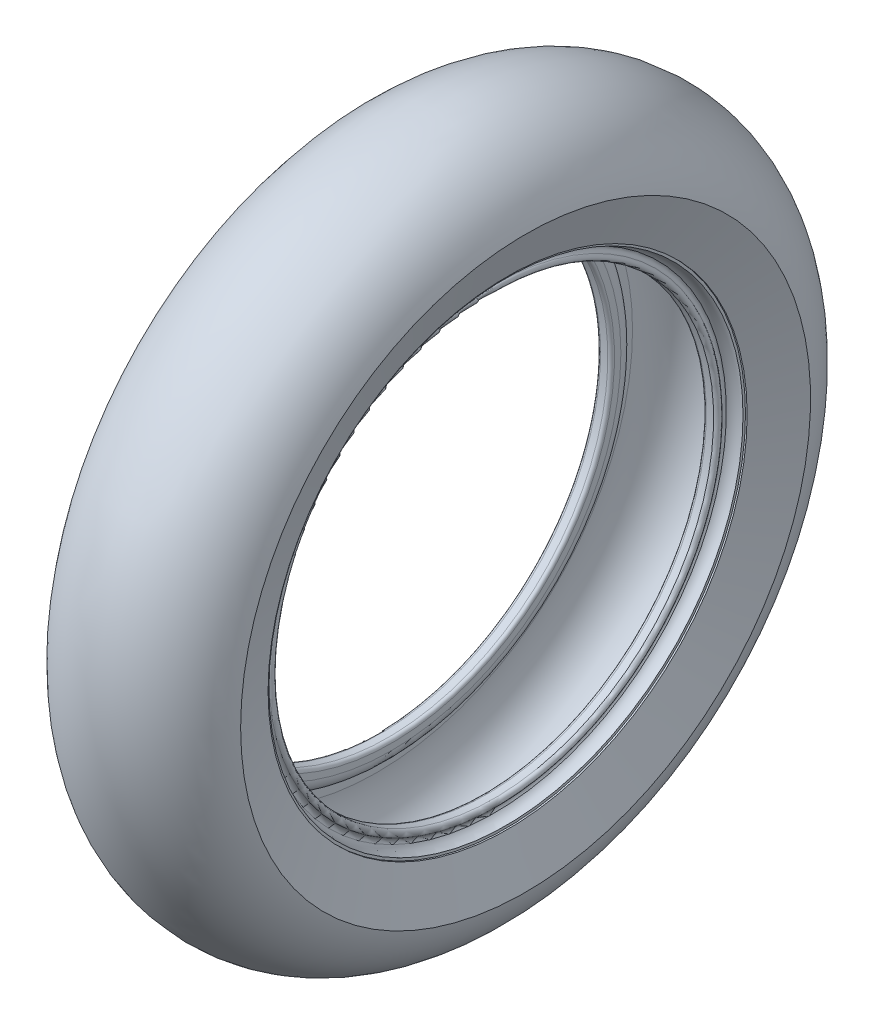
from build123d import *

# Parameters (mm, degrees)
ESQUISSE2_W             = 41.553002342
ESQUISSE2_H             = 53.672175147
ENL_V_MAT_EXTRU_1_DEPTH = 10


with BuildPart() as part:
    # Esquisse1 → Base-R_volution (revolve)
    with BuildSketch(Plane.XY, mode=Mode.PRIVATE) as base_r_volution_sk:
        with BuildLine():
            Line((-53.5, 172.26482306), (-42.626829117, 144.805600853))
            Line((-42.626829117, 144.805600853), (-41.626829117, 144.805600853))
            Line((-41.626829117, 144.805600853), (-41.626829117, 143.305600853))
            ThreePointArc((-41.626829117, 143.305600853), (-37.723440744, 142.680993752), (-34.595657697, 140.263650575))
            ThreePointArc((-34.595657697, 140.263650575), (-34.155579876, 138.445397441), (-35.233315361, 136.91628032))
            ThreePointArc((-35.233315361, 136.91628032), (-36.19600313, 134.554432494), (-34.169623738, 133.005600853))
            Line((-34.169623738, 133.005600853), (-29.770964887, 133.005600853))
            ThreePointArc((-29.770964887, 133.005600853), (-28.356751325, 133.591387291), (-27.770964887, 135.005600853))
            Line((-27.770964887, 135.005600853), (-27.770964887, 138.8692524))
            ThreePointArc((-27.770964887, 138.8692524), (-30.27011035, 144.934540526), (-36.316676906, 147.478647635))
            Line((-36.316676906, 147.478647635), (-36.316676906, 154.474486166))
            ThreePointArc((-36.316676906, 154.474486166), (0, 193.942485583), (36.316676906, 154.474486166))
            Line((36.316676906, 154.474486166), (36.316676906, 147.478647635))
            ThreePointArc((36.316676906, 147.478647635), (30.27011035, 144.934540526), (27.770964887, 138.8692524))
            Line((27.770964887, 138.8692524), (27.770964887, 135.005600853))
            ThreePointArc((27.770964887, 135.005600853), (28.356751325, 133.591387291), (29.770964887, 133.005600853))
            Line((29.770964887, 133.005600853), (34.169623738, 133.005600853))
            ThreePointArc((34.169623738, 133.005600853), (36.19600313, 134.554432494), (35.233315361, 136.91628032))
            ThreePointArc((35.233315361, 136.91628032), (34.155579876, 138.445397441), (34.595657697, 140.263650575))
            ThreePointArc((34.595657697, 140.263650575), (37.723440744, 142.680993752), (41.626829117, 143.305600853))
            Line((41.626829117, 143.305600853), (41.626829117, 144.805600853))
            Line((41.626829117, 144.805600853), (42.626829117, 144.805600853))
            Line((42.626829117, 144.805600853), (53.5, 172.26482306))
            ThreePointArc((53.5, 172.26482306), (0, 213), (-53.5, 172.26482306))
        make_face()
    revolve(base_r_volution_sk.sketch.rotate(Axis((-62.59165513, 0, 0), (1, 0, 0)), 90), axis=Axis((-62.59165513, 0, 0), (1, 0, 0)))

    # Esquisse2 → Enl_v. mat.-Extru.1 (cut)
    with BuildSketch(Plane(origin=(0, 0, 0), x_dir=(1, 0, 0), z_dir=(0, 1, 0))):
        with Locations((20.776501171, 221.127363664)):
            Rectangle(ESQUISSE2_W, ESQUISSE2_H)
    extrude(amount=-ENL_V_MAT_EXTRU_1_DEPTH, mode=Mode.SUBTRACT)


solid = part.part
